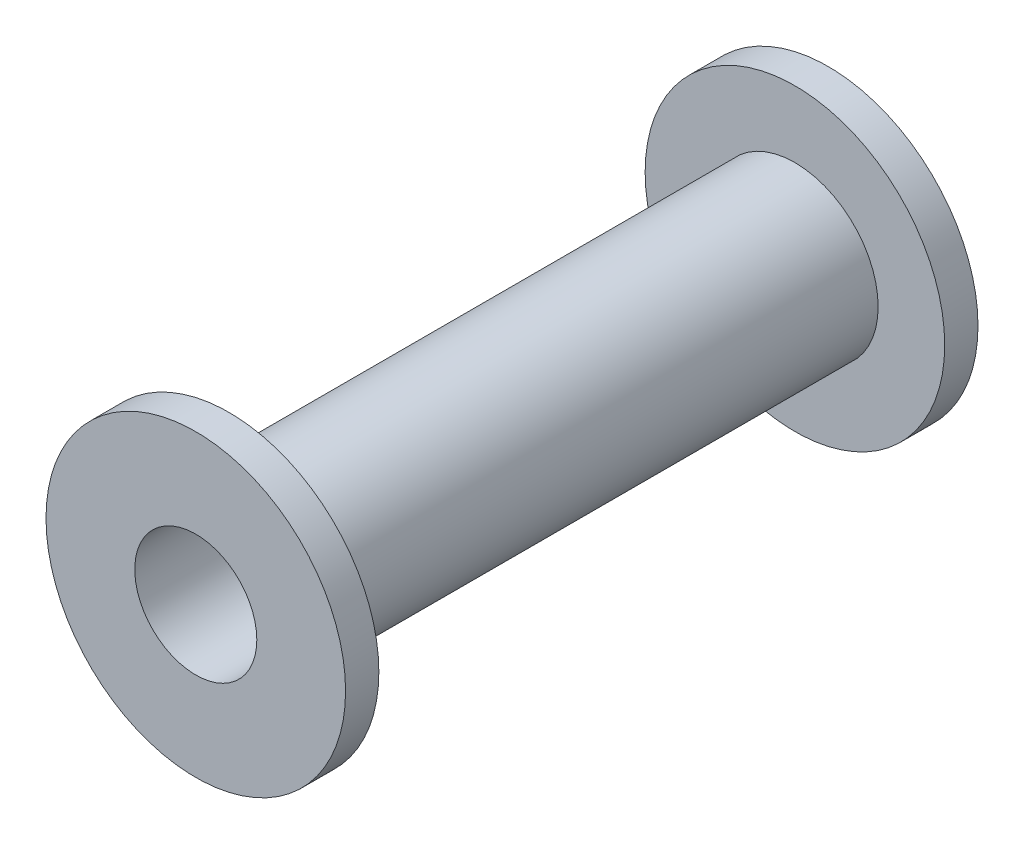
from build123d import *

# Parameters (mm, degrees)
ESBO_O1_R                = 13.5
ESBO_O1_R_2              = 5.5
RESSALTO_EXTRUS_O1_DEPTH = 3
ESBO_O2_R                = 7.5
ESBO_O2_R_2              = 5.5
RESSALTO_EXTRUS_O2_DEPTH = 51
ESBO_O3_R                = 13.5
ESBO_O3_R_2              = 5.5
RESSALTO_EXTRUS_O3_DEPTH = 3


with BuildPart() as part:
    # Esbo_o1 → Ressalto-extrus_o1 (new body)
    with BuildSketch(Plane.XY):
        Circle(ESBO_O1_R)
        Circle(ESBO_O1_R_2, mode=Mode.SUBTRACT)
    extrude(amount=RESSALTO_EXTRUS_O1_DEPTH)

    # Esbo_o2 → Ressalto-extrus_o2 (add)
    with BuildSketch(Plane.XY.offset(3)):
        Circle(ESBO_O2_R)
        Circle(ESBO_O2_R_2, mode=Mode.SUBTRACT)
    extrude(amount=RESSALTO_EXTRUS_O2_DEPTH)

    # Esbo_o3 → Ressalto-extrus_o3 (add)
    with BuildSketch(Plane.XY.offset(54)):
        Circle(ESBO_O3_R)
        Circle(ESBO_O3_R_2, mode=Mode.SUBTRACT)
    extrude(amount=RESSALTO_EXTRUS_O3_DEPTH)


solid = part.part
